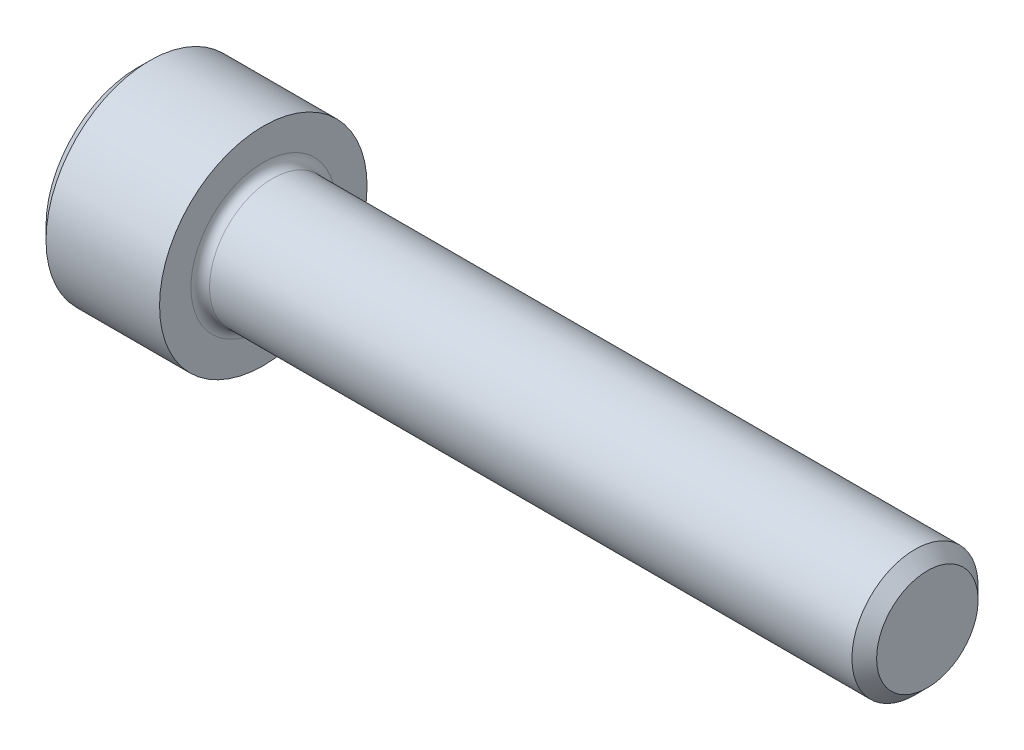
ISO-10303-21;
HEADER;
FILE_DESCRIPTION(('STEP AP214'),'2;1');
FILE_NAME('part.step','',(''),(''),'','','');
FILE_SCHEMA(('AUTOMOTIVE_DESIGN { 1 0 10303 214 1 1 1 1 }'));
ENDSEC;
DATA;
#1=APPLICATION_CONTEXT('core data for automotive mechanical design processes');
#2=APPLICATION_PROTOCOL_DEFINITION('international standard','automotive_design',2000,#1);
#3=PRODUCT_CONTEXT('',#1,'mechanical');
#4=PRODUCT('Part','Part','',(#3));
#5=PRODUCT_RELATED_PRODUCT_CATEGORY('part','',(#4));
#6=PRODUCT_DEFINITION_FORMATION('','',#4);
#7=PRODUCT_DEFINITION_CONTEXT('part definition',#1,'design');
#8=PRODUCT_DEFINITION('design','',#6,#7);
#9=PRODUCT_DEFINITION_SHAPE('','',#8);
#10=(LENGTH_UNIT() NAMED_UNIT(*) SI_UNIT(.MILLI.,.METRE.));
#11=(NAMED_UNIT(*) PLANE_ANGLE_UNIT() SI_UNIT($,.RADIAN.));
#12=(NAMED_UNIT(*) SI_UNIT($,.STERADIAN.) SOLID_ANGLE_UNIT());
#13=UNCERTAINTY_MEASURE_WITH_UNIT(LENGTH_MEASURE(1.E-05),#10,'distance_accuracy_value','');
#14=(GEOMETRIC_REPRESENTATION_CONTEXT(3) GLOBAL_UNCERTAINTY_ASSIGNED_CONTEXT((#13)) GLOBAL_UNIT_ASSIGNED_CONTEXT((#10,
#11,#12)) REPRESENTATION_CONTEXT('',''));
#15=CARTESIAN_POINT('',(0.,0.,0.));
#16=DIRECTION('',(0.,0.,1.));
#17=DIRECTION('',(1.,0.,0.));
#18=AXIS2_PLACEMENT_3D('',#15,#16,#17);
#19=CARTESIAN_POINT('',(0.,0.,0.));
#20=DIRECTION('',(-1.,0.,0.));
#21=DIRECTION('',(0.,0.,1.));
#22=AXIS2_PLACEMENT_3D('',#19,#20,#21);
#23=PLANE('',#22);
#24=DIRECTION('',(0.,-0.499999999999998,0.866025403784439));
#25=VECTOR('',#24,1.);
#26=CARTESIAN_POINT('',(0.,2.2920921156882,0.));
#27=LINE('',#26,#25);
#28=CARTESIAN_POINT('',(0.,2.2920921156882,0.));
#29=VERTEX_POINT('',#28);
#30=CARTESIAN_POINT('',(0.,1.14604605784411,1.98501));
#31=VERTEX_POINT('',#30);
#32=EDGE_CURVE('E373',#29,#31,#27,.T.);
#33=ORIENTED_EDGE('',*,*,#32,.T.);
#34=DIRECTION('',(0.,1.,0.));
#35=VECTOR('',#34,1.);
#36=CARTESIAN_POINT('',(0.,-1.14604605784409,1.98501));
#37=LINE('',#36,#35);
#38=CARTESIAN_POINT('',(0.,-1.14604605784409,1.98501));
#39=VERTEX_POINT('',#38);
#40=EDGE_CURVE('E129',#39,#31,#37,.T.);
#41=ORIENTED_EDGE('',*,*,#40,.F.);
#42=DIRECTION('',(0.,-0.500000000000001,-0.866025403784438));
#43=VECTOR('',#42,1.);
#44=CARTESIAN_POINT('',(0.,-1.14604605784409,1.98501));
#45=LINE('',#44,#43);
#46=CARTESIAN_POINT('',(0.,-2.29209211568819,0.));
#47=VERTEX_POINT('',#46);
#48=EDGE_CURVE('E376',#39,#47,#45,.T.);
#49=ORIENTED_EDGE('',*,*,#48,.T.);
#50=DIRECTION('',(0.,0.499999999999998,-0.86602540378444));
#51=VECTOR('',#50,1.);
#52=CARTESIAN_POINT('',(0.,-2.29209211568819,0.));
#53=LINE('',#52,#51);
#54=CARTESIAN_POINT('',(0.,-1.1460460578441,-1.98501));
#55=VERTEX_POINT('',#54);
#56=EDGE_CURVE('E379',#47,#55,#53,.T.);
#57=ORIENTED_EDGE('',*,*,#56,.T.);
#58=DIRECTION('',(0.,-1.,0.));
#59=VECTOR('',#58,1.);
#60=CARTESIAN_POINT('',(0.,1.1460460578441,-1.98501));
#61=LINE('',#60,#59);
#62=CARTESIAN_POINT('',(0.,1.1460460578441,-1.98501));
#63=VERTEX_POINT('',#62);
#64=EDGE_CURVE('E382',#63,#55,#61,.T.);
#65=ORIENTED_EDGE('',*,*,#64,.F.);
#66=DIRECTION('',(0.,-0.500000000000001,-0.866025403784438));
#67=VECTOR('',#66,1.);
#68=CARTESIAN_POINT('',(0.,2.2920921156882,0.));
#69=LINE('',#68,#67);
#70=EDGE_CURVE('E124',#29,#63,#69,.T.);
#71=ORIENTED_EDGE('',*,*,#70,.F.);
#72=EDGE_LOOP('',(#33,#41,#49,#57,#65,#71));
#73=FACE_BOUND('',#72,.T.);
#74=CARTESIAN_POINT('',(0.,0.,0.));
#75=DIRECTION('',(-1.,0.,0.));
#76=DIRECTION('',(0.,0.,1.));
#77=AXIS2_PLACEMENT_3D('',#74,#75,#76);
#78=CIRCLE('',#77,3.48615);
#79=CARTESIAN_POINT('',(0.,0.,3.48615));
#80=VERTEX_POINT('',#79);
#81=EDGE_CURVE('E140',#80,#80,#78,.T.);
#82=ORIENTED_EDGE('',*,*,#81,.T.);
#83=EDGE_LOOP('',(#82));
#84=FACE_BOUND('',#83,.T.);
#85=ADVANCED_FACE('F33',(#73,#84),#23,.T.);
#86=CARTESIAN_POINT('',(30.226,1.94056,0.));
#87=DIRECTION('',(1.,0.,0.));
#88=DIRECTION('',(0.,0.,-1.));
#89=AXIS2_PLACEMENT_3D('',#86,#87,#88);
#90=PLANE('',#89);
#91=CARTESIAN_POINT('',(30.226,0.,0.));
#92=DIRECTION('',(-1.,0.,0.));
#93=DIRECTION('',(0.,0.,1.));
#94=AXIS2_PLACEMENT_3D('',#91,#92,#93);
#95=CIRCLE('',#94,1.94056);
#96=CARTESIAN_POINT('',(30.226,0.,1.94056));
#97=VERTEX_POINT('',#96);
#98=EDGE_CURVE('E153',#97,#97,#95,.T.);
#99=ORIENTED_EDGE('',*,*,#98,.F.);
#100=EDGE_LOOP('',(#99));
#101=FACE_BOUND('',#100,.T.);
#102=ADVANCED_FACE('F174',(#101),#90,.T.);
#103=CARTESIAN_POINT('',(30.226,0.,0.));
#104=DIRECTION('',(-1.,0.,0.));
#105=DIRECTION('',(0.,0.,1.));
#106=AXIS2_PLACEMENT_3D('',#103,#104,#105);
#107=CONICAL_SURFACE('',#106,1.94056,0.785398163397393);
#108=CARTESIAN_POINT('',(29.75356,0.,0.));
#109=DIRECTION('',(-1.,0.,0.));
#110=DIRECTION('',(0.,0.,1.));
#111=AXIS2_PLACEMENT_3D('',#108,#109,#110);
#112=CIRCLE('',#111,2.41299999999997);
#113=CARTESIAN_POINT('',(29.75356,0.,2.41299999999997));
#114=VERTEX_POINT('',#113);
#115=EDGE_CURVE('E150',#114,#114,#112,.T.);
#116=ORIENTED_EDGE('',*,*,#115,.F.);
#117=EDGE_LOOP('',(#116));
#118=FACE_BOUND('',#117,.T.);
#119=ORIENTED_EDGE('',*,*,#98,.T.);
#120=EDGE_LOOP('',(#119));
#121=FACE_BOUND('',#120,.T.);
#122=ADVANCED_FACE('F180',(#118,#121),#107,.T.);
#123=CARTESIAN_POINT('',(-31.75,0.,0.));
#124=DIRECTION('',(-1.,0.,0.));
#125=DIRECTION('',(0.,0.,1.));
#126=AXIS2_PLACEMENT_3D('',#123,#124,#125);
#127=CYLINDRICAL_SURFACE('',#126,2.41299999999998);
#128=CARTESIAN_POINT('',(5.1816,0.,0.));
#129=DIRECTION('',(1.,0.,0.));
#130=DIRECTION('',(0.,0.,-1.));
#131=AXIS2_PLACEMENT_3D('',#128,#129,#130);
#132=CIRCLE('',#131,2.41299999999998);
#133=CARTESIAN_POINT('',(5.1816,0.,-2.41299999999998));
#134=VERTEX_POINT('',#133);
#135=EDGE_CURVE('E11',#134,#134,#132,.T.);
#136=ORIENTED_EDGE('',*,*,#135,.T.);
#137=EDGE_LOOP('',(#136));
#138=FACE_BOUND('',#137,.T.);
#139=ORIENTED_EDGE('',*,*,#115,.T.);
#140=EDGE_LOOP('',(#139));
#141=FACE_BOUND('',#140,.T.);
#142=ADVANCED_FACE('F191',(#138,#141),#127,.T.);
#143=CARTESIAN_POINT('',(4.826,3.96875,0.));
#144=DIRECTION('',(1.,0.,0.));
#145=DIRECTION('',(0.,0.,-1.));
#146=AXIS2_PLACEMENT_3D('',#143,#144,#145);
#147=PLANE('',#146);
#148=CARTESIAN_POINT('',(4.826,0.,0.));
#149=DIRECTION('',(1.,0.,0.));
#150=DIRECTION('',(0.,0.,-1.));
#151=AXIS2_PLACEMENT_3D('',#148,#149,#150);
#152=CIRCLE('',#151,2.76859999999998);
#153=CARTESIAN_POINT('',(4.826,0.,-2.76859999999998));
#154=VERTEX_POINT('',#153);
#155=EDGE_CURVE('E41',#154,#154,#152,.F.);
#156=ORIENTED_EDGE('',*,*,#155,.T.);
#157=EDGE_LOOP('',(#156));
#158=FACE_BOUND('',#157,.T.);
#159=CARTESIAN_POINT('',(4.826,0.,0.));
#160=DIRECTION('',(-1.,0.,0.));
#161=DIRECTION('',(0.,0.,1.));
#162=AXIS2_PLACEMENT_3D('',#159,#160,#161);
#163=CIRCLE('',#162,3.96875);
#164=CARTESIAN_POINT('',(4.826,0.,3.96875));
#165=VERTEX_POINT('',#164);
#166=EDGE_CURVE('E147',#165,#165,#163,.T.);
#167=ORIENTED_EDGE('',*,*,#166,.F.);
#168=EDGE_LOOP('',(#167));
#169=FACE_BOUND('',#168,.T.);
#170=ADVANCED_FACE('F158',(#158,#169),#147,.T.);
#171=CARTESIAN_POINT('',(-31.75,0.,0.));
#172=DIRECTION('',(-1.,0.,0.));
#173=DIRECTION('',(0.,0.,1.));
#174=AXIS2_PLACEMENT_3D('',#171,#172,#173);
#175=CYLINDRICAL_SURFACE('',#174,3.96875);
#176=ORIENTED_EDGE('',*,*,#166,.T.);
#177=EDGE_LOOP('',(#176));
#178=FACE_BOUND('',#177,.T.);
#179=CARTESIAN_POINT('',(0.4826,0.,0.));
#180=DIRECTION('',(-1.,0.,0.));
#181=DIRECTION('',(0.,0.,1.));
#182=AXIS2_PLACEMENT_3D('',#179,#180,#181);
#183=CIRCLE('',#182,3.96875);
#184=CARTESIAN_POINT('',(0.4826,0.,3.96875));
#185=VERTEX_POINT('',#184);
#186=EDGE_CURVE('E144',#185,#185,#183,.T.);
#187=ORIENTED_EDGE('',*,*,#186,.F.);
#188=EDGE_LOOP('',(#187));
#189=FACE_BOUND('',#188,.T.);
#190=ADVANCED_FACE('F169',(#178,#189),#175,.T.);
#191=CARTESIAN_POINT('',(0.,0.,0.));
#192=DIRECTION('',(1.,0.,0.));
#193=DIRECTION('',(0.,0.,-1.));
#194=AXIS2_PLACEMENT_3D('',#191,#192,#193);
#195=CONICAL_SURFACE('',#194,3.48615,0.78539816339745);
#196=ORIENTED_EDGE('',*,*,#186,.T.);
#197=EDGE_LOOP('',(#196));
#198=FACE_BOUND('',#197,.T.);
#199=ORIENTED_EDGE('',*,*,#81,.F.);
#200=EDGE_LOOP('',(#199));
#201=FACE_BOUND('',#200,.T.);
#202=ADVANCED_FACE('F162',(#198,#201),#195,.T.);
#203=CARTESIAN_POINT('',(5.1816,0.,0.));
#204=DIRECTION('',(1.,0.,0.));
#205=DIRECTION('',(0.,0.,-1.));
#206=AXIS2_PLACEMENT_3D('',#203,#204,#205);
#207=TOROIDAL_SURFACE('',#206,2.76859999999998,0.3556);
#208=ORIENTED_EDGE('',*,*,#135,.F.);
#209=EDGE_LOOP('',(#208));
#210=FACE_BOUND('',#209,.T.);
#211=ORIENTED_EDGE('',*,*,#155,.F.);
#212=EDGE_LOOP('',(#211));
#213=FACE_BOUND('',#212,.T.);
#214=ADVANCED_FACE('F35',(#210,#213),#207,.F.);
#215=CARTESIAN_POINT('',(2.286,2.2920921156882,0.));
#216=DIRECTION('',(0.,-0.866025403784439,-0.499999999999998));
#217=DIRECTION('',(0.,0.499999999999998,-0.86602540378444));
#218=AXIS2_PLACEMENT_3D('',#215,#216,#217);
#219=PLANE('',#218);
#220=ORIENTED_EDGE('',*,*,#32,.F.);
#221=DIRECTION('',(-1.,0.,0.));
#222=VECTOR('',#221,1.);
#223=CARTESIAN_POINT('',(2.286,2.2920921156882,0.));
#224=LINE('',#223,#222);
#225=CARTESIAN_POINT('',(2.286,2.2920921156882,0.));
#226=VERTEX_POINT('',#225);
#227=EDGE_CURVE('E363',#226,#29,#224,.T.);
#228=ORIENTED_EDGE('',*,*,#227,.F.);
#229=DIRECTION('',(0.,-0.499999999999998,0.866025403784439));
#230=VECTOR('',#229,1.);
#231=CARTESIAN_POINT('',(2.286,2.2920921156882,0.));
#232=LINE('',#231,#230);
#233=CARTESIAN_POINT('',(2.286,1.71906908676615,0.992504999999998));
#234=VERTEX_POINT('',#233);
#235=EDGE_CURVE('E116',#226,#234,#232,.T.);
#236=ORIENTED_EDGE('',*,*,#235,.T.);
#237=CARTESIAN_POINT('',(2.286,1.14604605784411,1.98501));
#238=VERTEX_POINT('',#237);
#239=EDGE_CURVE('E107',#234,#238,#232,.T.);
#240=ORIENTED_EDGE('',*,*,#239,.T.);
#241=DIRECTION('',(-1.,0.,0.));
#242=VECTOR('',#241,1.);
#243=CARTESIAN_POINT('',(2.286,1.14604605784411,1.98501));
#244=LINE('',#243,#242);
#245=EDGE_CURVE('E121',#238,#31,#244,.T.);
#246=ORIENTED_EDGE('',*,*,#245,.T.);
#247=EDGE_LOOP('',(#220,#228,#236,#240,#246));
#248=FACE_BOUND('',#247,.T.);
#249=ADVANCED_FACE('F120',(#248),#219,.T.);
#250=CARTESIAN_POINT('',(2.286,-1.14604605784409,1.98501));
#251=DIRECTION('',(0.,0.,1.));
#252=DIRECTION('',(0.,-1.,0.));
#253=AXIS2_PLACEMENT_3D('',#250,#251,#252);
#254=PLANE('',#253);
#255=ORIENTED_EDGE('',*,*,#40,.T.);
#256=ORIENTED_EDGE('',*,*,#245,.F.);
#257=DIRECTION('',(0.,1.,0.));
#258=VECTOR('',#257,1.);
#259=CARTESIAN_POINT('',(2.286,-1.14604605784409,1.98501));
#260=LINE('',#259,#258);
#261=CARTESIAN_POINT('',(2.286,0.,1.98501));
#262=VERTEX_POINT('',#261);
#263=EDGE_CURVE('E104',#262,#238,#260,.T.);
#264=ORIENTED_EDGE('',*,*,#263,.F.);
#265=CARTESIAN_POINT('',(2.286,-1.14604605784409,1.98501));
#266=VERTEX_POINT('',#265);
#267=EDGE_CURVE('E115',#266,#262,#260,.T.);
#268=ORIENTED_EDGE('',*,*,#267,.F.);
#269=DIRECTION('',(-1.,0.,0.));
#270=VECTOR('',#269,1.);
#271=CARTESIAN_POINT('',(2.286,-1.14604605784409,1.98501));
#272=LINE('',#271,#270);
#273=EDGE_CURVE('E131',#266,#39,#272,.T.);
#274=ORIENTED_EDGE('',*,*,#273,.T.);
#275=EDGE_LOOP('',(#255,#256,#264,#268,#274));
#276=FACE_BOUND('',#275,.T.);
#277=ADVANCED_FACE('F126',(#276),#254,.F.);
#278=CARTESIAN_POINT('',(2.286,-1.14604605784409,1.98501));
#279=DIRECTION('',(0.,0.866025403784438,-0.500000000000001));
#280=DIRECTION('',(0.,0.500000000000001,0.866025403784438));
#281=AXIS2_PLACEMENT_3D('',#278,#279,#280);
#282=PLANE('',#281);
#283=ORIENTED_EDGE('',*,*,#48,.F.);
#284=ORIENTED_EDGE('',*,*,#273,.F.);
#285=DIRECTION('',(0.,-0.500000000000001,-0.866025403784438));
#286=VECTOR('',#285,1.);
#287=CARTESIAN_POINT('',(2.286,-1.14604605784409,1.98501));
#288=LINE('',#287,#286);
#289=CARTESIAN_POINT('',(2.286,-1.71906908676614,0.992504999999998));
#290=VERTEX_POINT('',#289);
#291=EDGE_CURVE('E402',#266,#290,#288,.T.);
#292=ORIENTED_EDGE('',*,*,#291,.T.);
#293=CARTESIAN_POINT('',(2.286,-2.29209211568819,0.));
#294=VERTEX_POINT('',#293);
#295=EDGE_CURVE('E391',#290,#294,#288,.T.);
#296=ORIENTED_EDGE('',*,*,#295,.T.);
#297=DIRECTION('',(-1.,0.,0.));
#298=VECTOR('',#297,1.);
#299=CARTESIAN_POINT('',(2.286,-2.29209211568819,0.));
#300=LINE('',#299,#298);
#301=EDGE_CURVE('E136',#294,#47,#300,.T.);
#302=ORIENTED_EDGE('',*,*,#301,.T.);
#303=EDGE_LOOP('',(#283,#284,#292,#296,#302));
#304=FACE_BOUND('',#303,.T.);
#305=ADVANCED_FACE('F254',(#304),#282,.T.);
#306=CARTESIAN_POINT('',(2.286,-2.29209211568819,0.));
#307=DIRECTION('',(0.,0.86602540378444,0.499999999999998));
#308=DIRECTION('',(0.,-0.499999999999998,0.86602540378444));
#309=AXIS2_PLACEMENT_3D('',#306,#307,#308);
#310=PLANE('',#309);
#311=ORIENTED_EDGE('',*,*,#56,.F.);
#312=ORIENTED_EDGE('',*,*,#301,.F.);
#313=DIRECTION('',(0.,0.499999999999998,-0.86602540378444));
#314=VECTOR('',#313,1.);
#315=CARTESIAN_POINT('',(2.286,-2.29209211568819,0.));
#316=LINE('',#315,#314);
#317=CARTESIAN_POINT('',(2.286,-1.71906908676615,-0.992504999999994));
#318=VERTEX_POINT('',#317);
#319=EDGE_CURVE('E369',#294,#318,#316,.T.);
#320=ORIENTED_EDGE('',*,*,#319,.T.);
#321=CARTESIAN_POINT('',(2.286,-1.1460460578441,-1.98501));
#322=VERTEX_POINT('',#321);
#323=EDGE_CURVE('E401',#318,#322,#316,.T.);
#324=ORIENTED_EDGE('',*,*,#323,.T.);
#325=DIRECTION('',(-1.,0.,0.));
#326=VECTOR('',#325,1.);
#327=CARTESIAN_POINT('',(2.286,-1.1460460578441,-1.98501));
#328=LINE('',#327,#326);
#329=EDGE_CURVE('E362',#322,#55,#328,.T.);
#330=ORIENTED_EDGE('',*,*,#329,.T.);
#331=EDGE_LOOP('',(#311,#312,#320,#324,#330));
#332=FACE_BOUND('',#331,.T.);
#333=ADVANCED_FACE('F262',(#332),#310,.T.);
#334=CARTESIAN_POINT('',(2.286,1.1460460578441,-1.98501));
#335=DIRECTION('',(0.,0.,-1.));
#336=DIRECTION('',(0.,1.,0.));
#337=AXIS2_PLACEMENT_3D('',#334,#335,#336);
#338=PLANE('',#337);
#339=ORIENTED_EDGE('',*,*,#64,.T.);
#340=ORIENTED_EDGE('',*,*,#329,.F.);
#341=DIRECTION('',(0.,-1.,0.));
#342=VECTOR('',#341,1.);
#343=CARTESIAN_POINT('',(2.286,1.1460460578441,-1.98501));
#344=LINE('',#343,#342);
#345=CARTESIAN_POINT('',(2.286,0.,-1.98501));
#346=VERTEX_POINT('',#345);
#347=EDGE_CURVE('E366',#346,#322,#344,.T.);
#348=ORIENTED_EDGE('',*,*,#347,.F.);
#349=CARTESIAN_POINT('',(2.286,1.1460460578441,-1.98501));
#350=VERTEX_POINT('',#349);
#351=EDGE_CURVE('E48',#350,#346,#344,.T.);
#352=ORIENTED_EDGE('',*,*,#351,.F.);
#353=DIRECTION('',(-1.,0.,0.));
#354=VECTOR('',#353,1.);
#355=CARTESIAN_POINT('',(2.286,1.1460460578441,-1.98501));
#356=LINE('',#355,#354);
#357=EDGE_CURVE('E359',#350,#63,#356,.T.);
#358=ORIENTED_EDGE('',*,*,#357,.T.);
#359=EDGE_LOOP('',(#339,#340,#348,#352,#358));
#360=FACE_BOUND('',#359,.T.);
#361=ADVANCED_FACE('F271',(#360),#338,.F.);
#362=CARTESIAN_POINT('',(2.286,2.2920921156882,0.));
#363=DIRECTION('',(0.,0.866025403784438,-0.500000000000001));
#364=DIRECTION('',(0.,0.500000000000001,0.866025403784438));
#365=AXIS2_PLACEMENT_3D('',#362,#363,#364);
#366=PLANE('',#365);
#367=ORIENTED_EDGE('',*,*,#70,.T.);
#368=ORIENTED_EDGE('',*,*,#357,.F.);
#369=DIRECTION('',(0.,-0.500000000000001,-0.866025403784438));
#370=VECTOR('',#369,1.);
#371=CARTESIAN_POINT('',(2.286,2.2920921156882,0.));
#372=LINE('',#371,#370);
#373=CARTESIAN_POINT('',(2.286,1.71906908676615,-0.992505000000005));
#374=VERTEX_POINT('',#373);
#375=EDGE_CURVE('E349',#374,#350,#372,.T.);
#376=ORIENTED_EDGE('',*,*,#375,.F.);
#377=EDGE_CURVE('E355',#226,#374,#372,.T.);
#378=ORIENTED_EDGE('',*,*,#377,.F.);
#379=ORIENTED_EDGE('',*,*,#227,.T.);
#380=EDGE_LOOP('',(#367,#368,#376,#378,#379));
#381=FACE_BOUND('',#380,.T.);
#382=ADVANCED_FACE('F280',(#381),#366,.F.);
#383=CARTESIAN_POINT('',(2.286,3.4381381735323,-1.98501000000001));
#384=DIRECTION('',(1.,0.,0.));
#385=DIRECTION('',(0.,0.,-1.));
#386=AXIS2_PLACEMENT_3D('',#383,#384,#385);
#387=PLANE('',#386);
#388=ORIENTED_EDGE('',*,*,#347,.T.);
#389=ORIENTED_EDGE('',*,*,#323,.F.);
#390=CARTESIAN_POINT('',(2.286,0.,0.));
#391=DIRECTION('',(-1.,0.,0.));
#392=DIRECTION('',(0.,0.,1.));
#393=AXIS2_PLACEMENT_3D('',#390,#391,#392);
#394=CIRCLE('',#393,1.98501);
#395=EDGE_CURVE('E397',#346,#318,#394,.T.);
#396=ORIENTED_EDGE('',*,*,#395,.F.);
#397=EDGE_LOOP('',(#388,#389,#396));
#398=FACE_BOUND('',#397,.T.);
#399=ADVANCED_FACE('F289',(#398),#387,.F.);
#400=ORIENTED_EDGE('',*,*,#319,.F.);
#401=ORIENTED_EDGE('',*,*,#295,.F.);
#402=EDGE_CURVE('E134',#318,#290,#394,.T.);
#403=ORIENTED_EDGE('',*,*,#402,.F.);
#404=EDGE_LOOP('',(#400,#401,#403));
#405=FACE_BOUND('',#404,.T.);
#406=ADVANCED_FACE('F298',(#405),#387,.F.);
#407=ORIENTED_EDGE('',*,*,#291,.F.);
#408=ORIENTED_EDGE('',*,*,#267,.T.);
#409=EDGE_CURVE('E130',#290,#262,#394,.T.);
#410=ORIENTED_EDGE('',*,*,#409,.F.);
#411=EDGE_LOOP('',(#407,#408,#410));
#412=FACE_BOUND('',#411,.T.);
#413=ADVANCED_FACE('F307',(#412),#387,.F.);
#414=ORIENTED_EDGE('',*,*,#263,.T.);
#415=ORIENTED_EDGE('',*,*,#239,.F.);
#416=EDGE_CURVE('E110',#262,#234,#394,.T.);
#417=ORIENTED_EDGE('',*,*,#416,.F.);
#418=EDGE_LOOP('',(#414,#415,#417));
#419=FACE_BOUND('',#418,.T.);
#420=ADVANCED_FACE('F106',(#419),#387,.F.);
#421=ORIENTED_EDGE('',*,*,#235,.F.);
#422=ORIENTED_EDGE('',*,*,#377,.T.);
#423=EDGE_CURVE('E141',#234,#374,#394,.T.);
#424=ORIENTED_EDGE('',*,*,#423,.F.);
#425=EDGE_LOOP('',(#421,#422,#424));
#426=FACE_BOUND('',#425,.T.);
#427=ADVANCED_FACE('F322',(#426),#387,.F.);
#428=ORIENTED_EDGE('',*,*,#375,.T.);
#429=ORIENTED_EDGE('',*,*,#351,.T.);
#430=EDGE_CURVE('E352',#374,#346,#394,.T.);
#431=ORIENTED_EDGE('',*,*,#430,.F.);
#432=EDGE_LOOP('',(#428,#429,#431));
#433=FACE_BOUND('',#432,.T.);
#434=ADVANCED_FACE('F237',(#433),#387,.F.);
#435=CARTESIAN_POINT('',(2.286,0.,0.));
#436=DIRECTION('',(-1.,0.,0.));
#437=DIRECTION('',(0.,0.,1.));
#438=AXIS2_PLACEMENT_3D('',#435,#436,#437);
#439=CONICAL_SURFACE('',#438,1.98501,1.04719755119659);
#440=CARTESIAN_POINT('',(3.43204605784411,0.,0.));
#441=VERTEX_POINT('',#440);
#442=VERTEX_LOOP('',#441);
#443=FACE_BOUND('',#442,.T.);
#444=ORIENTED_EDGE('',*,*,#416,.T.);
#445=ORIENTED_EDGE('',*,*,#423,.T.);
#446=ORIENTED_EDGE('',*,*,#430,.T.);
#447=ORIENTED_EDGE('',*,*,#395,.T.);
#448=ORIENTED_EDGE('',*,*,#402,.T.);
#449=ORIENTED_EDGE('',*,*,#409,.T.);
#450=EDGE_LOOP('',(#444,#445,#446,#447,#448,#449));
#451=FACE_BOUND('',#450,.T.);
#452=ADVANCED_FACE('F184',(#443,#451),#439,.F.);
#453=CLOSED_SHELL('',(#85,#102,#122,#142,#170,#190,#202,#214,#249,#277,#305,#333,#361,#382,#399,
#406,#413,#420,#427,#434,#452));
#454=MANIFOLD_SOLID_BREP('B2',#453);
#455=ADVANCED_BREP_SHAPE_REPRESENTATION('',(#18,#454),#14);
#456=SHAPE_DEFINITION_REPRESENTATION(#9,#455);
ENDSEC;
END-ISO-10303-21;
